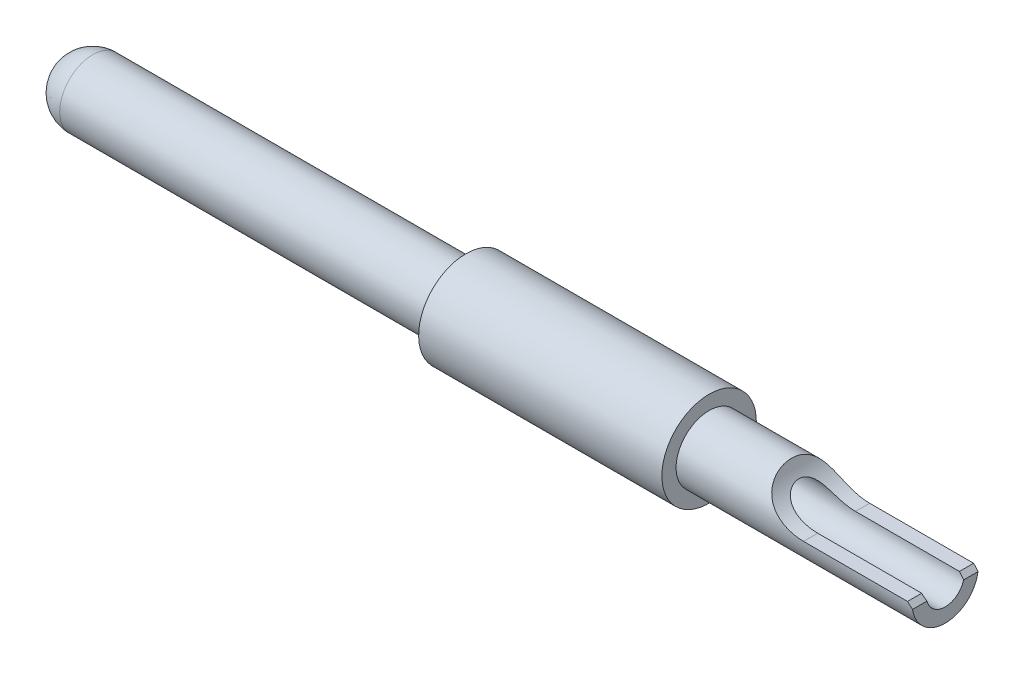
ISO-10303-21;
HEADER;
FILE_DESCRIPTION(('STEP AP214'),'2;1');
FILE_NAME('part.step','',(''),(''),'','','');
FILE_SCHEMA(('AUTOMOTIVE_DESIGN { 1 0 10303 214 1 1 1 1 }'));
ENDSEC;
DATA;
#1=APPLICATION_CONTEXT('core data for automotive mechanical design processes');
#2=APPLICATION_PROTOCOL_DEFINITION('international standard','automotive_design',2000,#1);
#3=PRODUCT_CONTEXT('',#1,'mechanical');
#4=PRODUCT('Part','Part','',(#3));
#5=PRODUCT_RELATED_PRODUCT_CATEGORY('part','',(#4));
#6=PRODUCT_DEFINITION_FORMATION('','',#4);
#7=PRODUCT_DEFINITION_CONTEXT('part definition',#1,'design');
#8=PRODUCT_DEFINITION('design','',#6,#7);
#9=PRODUCT_DEFINITION_SHAPE('','',#8);
#10=(LENGTH_UNIT() NAMED_UNIT(*) SI_UNIT(.MILLI.,.METRE.));
#11=(NAMED_UNIT(*) PLANE_ANGLE_UNIT() SI_UNIT($,.RADIAN.));
#12=(NAMED_UNIT(*) SI_UNIT($,.STERADIAN.) SOLID_ANGLE_UNIT());
#13=UNCERTAINTY_MEASURE_WITH_UNIT(LENGTH_MEASURE(1.E-05),#10,'distance_accuracy_value','');
#14=(GEOMETRIC_REPRESENTATION_CONTEXT(3) GLOBAL_UNCERTAINTY_ASSIGNED_CONTEXT((#13)) GLOBAL_UNIT_ASSIGNED_CONTEXT((#10,
#11,#12)) REPRESENTATION_CONTEXT('',''));
#15=CARTESIAN_POINT('',(0.,0.,0.));
#16=DIRECTION('',(0.,0.,1.));
#17=DIRECTION('',(1.,0.,0.));
#18=AXIS2_PLACEMENT_3D('',#15,#16,#17);
#19=CARTESIAN_POINT('',(9.74999999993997,0.,0.));
#20=DIRECTION('',(1.,0.,0.));
#21=DIRECTION('',(0.,0.,-1.));
#22=AXIS2_PLACEMENT_3D('',#19,#20,#21);
#23=CONICAL_SURFACE('',#22,0.399999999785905,1.04719755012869);
#24=CARTESIAN_POINT('',(9.75,0.,0.));
#25=DIRECTION('',(1.,0.,0.));
#26=DIRECTION('',(0.,0.,-1.));
#27=AXIS2_PLACEMENT_3D('',#24,#25,#26);
#28=CIRCLE('',#27,0.4);
#29=CARTESIAN_POINT('',(9.75000000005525,0.399999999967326,0.));
#30=VERTEX_POINT('',#29);
#31=EDGE_CURVE('E79',#30,#30,#28,.T.);
#32=ORIENTED_EDGE('',*,*,#31,.T.);
#33=DIRECTION('',(-0.499999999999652,-0.86602540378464,0.));
#34=VECTOR('',#33,1.);
#35=CARTESIAN_POINT('',(288107.303385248,499000.,0.));
#36=LINE('',#35,#34);
#37=CARTESIAN_POINT('',(9.51905989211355,-5.11590769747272E-10,0.));
#38=VERTEX_POINT('',#37);
#39=EDGE_CURVE('E81',#38,#30,#36,.F.);
#40=ORIENTED_EDGE('',*,*,#39,.F.);
#41=ORIENTED_EDGE('',*,*,#39,.T.);
#42=EDGE_LOOP('',(#32,#40,#41));
#43=FACE_BOUND('',#42,.T.);
#44=ADVANCED_FACE('F17',(#43),#23,.F.);
#45=CARTESIAN_POINT('',(9.75,0.,0.));
#46=DIRECTION('',(1.,0.,0.));
#47=DIRECTION('',(0.,0.,-1.));
#48=AXIS2_PLACEMENT_3D('',#45,#46,#47);
#49=CYLINDRICAL_SURFACE('',#48,0.4);
#50=CARTESIAN_POINT('',(13.75,0.,0.));
#51=DIRECTION('',(1.,0.,0.));
#52=DIRECTION('',(0.,0.,-1.));
#53=AXIS2_PLACEMENT_3D('',#50,#51,#52);
#54=CIRCLE('',#53,0.4);
#55=CARTESIAN_POINT('',(13.75,-0.0999999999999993,-0.387298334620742));
#56=VERTEX_POINT('',#55);
#57=CARTESIAN_POINT('',(13.75,-0.0999999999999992,0.387298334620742));
#58=VERTEX_POINT('',#57);
#59=EDGE_CURVE('E122',#56,#58,#54,.F.);
#60=ORIENTED_EDGE('',*,*,#59,.F.);
#61=CARTESIAN_POINT('',(13.65,0.,0.));
#62=DIRECTION('',(0.707106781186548,0.707106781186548,0.));
#63=DIRECTION('',(0.707106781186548,-0.707106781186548,0.));
#64=AXIS2_PLACEMENT_3D('',#61,#62,#63);
#65=ELLIPSE('',#64,0.565685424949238,0.4);
#66=CARTESIAN_POINT('',(13.65,0.,-0.4));
#67=VERTEX_POINT('',#66);
#68=EDGE_CURVE('E118',#67,#56,#65,.F.);
#69=ORIENTED_EDGE('',*,*,#68,.F.);
#70=DIRECTION('',(1.,0.,0.));
#71=VECTOR('',#70,1.);
#72=CARTESIAN_POINT('',(11.45,0.,-0.400000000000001));
#73=LINE('',#72,#71);
#74=CARTESIAN_POINT('',(11.45,0.,-0.400000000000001));
#75=VERTEX_POINT('',#74);
#76=EDGE_CURVE('E179',#67,#75,#73,.F.);
#77=ORIENTED_EDGE('',*,*,#76,.T.);
#78=CARTESIAN_POINT('',(11.45,0.,-0.4));
#79=CARTESIAN_POINT('',(11.4220448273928,-2.80562355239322E-06,-0.399978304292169));
#80=CARTESIAN_POINT('',(11.3940904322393,0.00117216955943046,-0.399999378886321));
#81=CARTESIAN_POINT('',(11.3383616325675,0.00585826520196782,-0.399969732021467));
#82=CARTESIAN_POINT('',(11.3105873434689,0.00937075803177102,-0.399918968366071));
#83=CARTESIAN_POINT('',(11.2552149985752,0.0187489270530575,-0.399586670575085));
#84=CARTESIAN_POINT('',(11.2276200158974,0.0246327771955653,-0.399303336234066));
#85=CARTESIAN_POINT('',(11.1730496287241,0.0387027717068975,-0.39818560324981));
#86=CARTESIAN_POINT('',(11.1460739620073,0.0468879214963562,-0.397351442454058));
#87=CARTESIAN_POINT('',(11.0808448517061,0.0697308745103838,-0.394115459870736));
#88=CARTESIAN_POINT('',(11.0430435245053,0.0856392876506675,-0.391173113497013));
#89=CARTESIAN_POINT('',(10.9701525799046,0.121714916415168,-0.381487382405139));
#90=CARTESIAN_POINT('',(10.9350524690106,0.141864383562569,-0.37475964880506));
#91=CARTESIAN_POINT('',(10.8793481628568,0.178364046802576,-0.358393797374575));
#92=CARTESIAN_POINT('',(10.857709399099,0.193855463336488,-0.350384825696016));
#93=CARTESIAN_POINT('',(10.8167282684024,0.225639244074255,-0.330808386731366));
#94=CARTESIAN_POINT('',(10.7973830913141,0.241930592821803,-0.319245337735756));
#95=CARTESIAN_POINT('',(10.7652119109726,0.271001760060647,-0.29469172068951));
#96=CARTESIAN_POINT('',(10.7518571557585,0.283829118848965,-0.282455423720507));
#97=CARTESIAN_POINT('',(10.7273343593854,0.308583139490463,-0.255176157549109));
#98=CARTESIAN_POINT('',(10.716165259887,0.320510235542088,-0.240134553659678));
#99=CARTESIAN_POINT('',(10.6962107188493,0.342711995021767,-0.207231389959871));
#100=CARTESIAN_POINT('',(10.6874445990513,0.352973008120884,-0.189348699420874));
#101=CARTESIAN_POINT('',(10.672605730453,0.370878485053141,-0.151296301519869));
#102=CARTESIAN_POINT('',(10.6665309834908,0.378524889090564,-0.131128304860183));
#103=CARTESIAN_POINT('',(10.6579067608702,0.389564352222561,-0.0925934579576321));
#104=CARTESIAN_POINT('',(10.6549486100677,0.393442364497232,-0.0744551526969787));
#105=CARTESIAN_POINT('',(10.6509917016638,0.39867781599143,-0.0375522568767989));
#106=CARTESIAN_POINT('',(10.6499992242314,0.400027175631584,-0.0187858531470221));
#107=CARTESIAN_POINT('',(10.65,0.4,0.));
#108=B_SPLINE_CURVE_WITH_KNOTS('',3,(#78,#79,#80,#81,#82,#83,#84,#85,#86,#87,#88,#89,#90,#91,
#92,#93,#94,#95,#96,#97,#98,#99,#100,#101,#102,#103,#104,#105,#106,#107),.UNSPECIFIED.,.F.,.F.,
(4,2,2,2,2,2,2,2,2,2,2,2,2,2,4),(0.,0.0838394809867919,0.167728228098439,0.252272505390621,
0.336780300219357,0.459731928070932,0.582178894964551,0.665291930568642,0.74830205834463,
0.81462467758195,0.880915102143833,0.947723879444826,1.01448297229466,1.07055447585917,
1.12680483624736),.UNSPECIFIED.);
#109=CARTESIAN_POINT('',(10.65,0.4,0.));
#110=VERTEX_POINT('',#109);
#111=EDGE_CURVE('E71',#75,#110,#108,.T.);
#112=ORIENTED_EDGE('',*,*,#111,.T.);
#113=DIRECTION('',(1.,0.,0.));
#114=VECTOR('',#113,1.);
#115=CARTESIAN_POINT('',(9.75,0.4,0.));
#116=LINE('',#115,#114);
#117=EDGE_CURVE('E20',#110,#30,#116,.F.);
#118=ORIENTED_EDGE('',*,*,#117,.T.);
#119=ORIENTED_EDGE('',*,*,#31,.F.);
#120=ORIENTED_EDGE('',*,*,#117,.F.);
#121=CARTESIAN_POINT('',(10.65,0.4,0.));
#122=CARTESIAN_POINT('',(10.6499978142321,0.400028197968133,0.0185897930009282));
#123=CARTESIAN_POINT('',(10.6509707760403,0.398705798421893,0.0371661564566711));
#124=CARTESIAN_POINT('',(10.6548484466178,0.393574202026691,0.0737051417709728));
#125=CARTESIAN_POINT('',(10.6577468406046,0.389773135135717,0.0916695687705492));
#126=CARTESIAN_POINT('',(10.6654565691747,0.379896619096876,0.126524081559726));
#127=CARTESIAN_POINT('',(10.6702676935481,0.373821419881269,0.143414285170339));
#128=CARTESIAN_POINT('',(10.6817580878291,0.359775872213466,0.17570170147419));
#129=CARTESIAN_POINT('',(10.6884378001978,0.351805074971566,0.191098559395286));
#130=CARTESIAN_POINT('',(10.703774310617,0.33420263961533,0.220476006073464));
#131=CARTESIAN_POINT('',(10.7124783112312,0.32453296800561,0.234408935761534));
#132=CARTESIAN_POINT('',(10.731606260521,0.304222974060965,0.260228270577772));
#133=CARTESIAN_POINT('',(10.7420311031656,0.293582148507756,0.272113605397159));
#134=CARTESIAN_POINT('',(10.7688722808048,0.267513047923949,0.298157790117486));
#135=CARTESIAN_POINT('',(10.7860225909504,0.251863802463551,0.311340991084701));
#136=CARTESIAN_POINT('',(10.8227527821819,0.220805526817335,0.334091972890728));
#137=CARTESIAN_POINT('',(10.8423369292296,0.205396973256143,0.343653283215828));
#138=CARTESIAN_POINT('',(10.892253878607,0.169199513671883,0.363263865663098));
#139=CARTESIAN_POINT('',(10.923584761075,0.14894962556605,0.371751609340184));
#140=CARTESIAN_POINT('',(10.9889801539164,0.111805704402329,0.384559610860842));
#141=CARTESIAN_POINT('',(11.023052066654,0.0949212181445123,0.38886814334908));
#142=CARTESIAN_POINT('',(11.1072621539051,0.0590510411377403,0.396200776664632));
#143=CARTESIAN_POINT('',(11.1583212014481,0.0419811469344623,0.397999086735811));
#144=CARTESIAN_POINT('',(11.2624631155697,0.0162793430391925,0.399876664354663));
#145=CARTESIAN_POINT('',(11.3155433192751,0.00763670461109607,0.399958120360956));
#146=CARTESIAN_POINT('',(11.3824070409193,0.00219469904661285,0.399993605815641));
#147=CARTESIAN_POINT('',(11.395925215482,0.00137109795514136,0.399997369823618));
#148=CARTESIAN_POINT('',(11.4229608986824,0.000274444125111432,0.400000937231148));
#149=CARTESIAN_POINT('',(11.4364783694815,4.59003678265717E-07,0.400000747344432));
#150=CARTESIAN_POINT('',(11.45,0.,0.4));
#151=B_SPLINE_CURVE_WITH_KNOTS('',3,(#121,#122,#123,#124,#125,#126,#127,#128,#129,#130,#131,
#132,#133,#134,#135,#136,#137,#138,#139,#140,#141,#142,#143,#144,#145,#146,#147,#148,#149,#150),
.UNSPECIFIED.,.F.,.F.,(4,2,2,2,2,2,2,2,2,2,2,2,2,2,4),(0.,0.0556761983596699,0.111170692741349,
0.166659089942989,0.222160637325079,0.279115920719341,0.336100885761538,0.415748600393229,
0.495537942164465,0.609672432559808,0.724126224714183,0.884907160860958,1.04548313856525,
1.08610590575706,1.12665970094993),.UNSPECIFIED.);
#152=CARTESIAN_POINT('',(11.45,0.,0.400000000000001));
#153=VERTEX_POINT('',#152);
#154=EDGE_CURVE('E175',#110,#153,#151,.T.);
#155=ORIENTED_EDGE('',*,*,#154,.T.);
#156=DIRECTION('',(1.,0.,0.));
#157=VECTOR('',#156,1.);
#158=CARTESIAN_POINT('',(11.45,0.,0.400000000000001));
#159=LINE('',#158,#157);
#160=CARTESIAN_POINT('',(13.65,0.,0.400000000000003));
#161=VERTEX_POINT('',#160);
#162=EDGE_CURVE('E221',#153,#161,#159,.T.);
#163=ORIENTED_EDGE('',*,*,#162,.T.);
#164=CARTESIAN_POINT('',(13.65,0.,0.));
#165=DIRECTION('',(0.707106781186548,0.707106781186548,0.));
#166=DIRECTION('',(0.707106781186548,-0.707106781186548,0.));
#167=AXIS2_PLACEMENT_3D('',#164,#165,#166);
#168=ELLIPSE('',#167,0.565685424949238,0.4);
#169=EDGE_CURVE('E169',#58,#161,#168,.F.);
#170=ORIENTED_EDGE('',*,*,#169,.F.);
#171=EDGE_LOOP('',(#60,#69,#77,#112,#118,#119,#120,#155,#163,#170));
#172=FACE_BOUND('',#171,.T.);
#173=ADVANCED_FACE('F183',(#172),#49,.F.);
#174=CARTESIAN_POINT('',(11.45,1.,20.973070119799));
#175=DIRECTION('',(0.,0.,1.));
#176=DIRECTION('',(1.,0.,0.));
#177=AXIS2_PLACEMENT_3D('',#174,#175,#176);
#178=CYLINDRICAL_SURFACE('',#177,1.);
#179=ORIENTED_EDGE('',*,*,#111,.F.);
#180=DIRECTION('',(0.,0.,-1.));
#181=VECTOR('',#180,1.);
#182=CARTESIAN_POINT('',(11.45,0.,20.973070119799));
#183=LINE('',#182,#181);
#184=CARTESIAN_POINT('',(11.45,0.,-0.7));
#185=VERTEX_POINT('',#184);
#186=EDGE_CURVE('E225',#75,#185,#183,.T.);
#187=ORIENTED_EDGE('',*,*,#186,.T.);
#188=CARTESIAN_POINT('',(10.4960607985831,0.7,0.));
#189=CARTESIAN_POINT('',(10.4960637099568,0.700000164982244,-0.018467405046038));
#190=CARTESIAN_POINT('',(10.496290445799,0.699268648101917,-0.036926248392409));
#191=CARTESIAN_POINT('',(10.4972138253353,0.696352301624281,-0.0737180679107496));
#192=CARTESIAN_POINT('',(10.4979104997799,0.694167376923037,-0.0920510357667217));
#193=CARTESIAN_POINT('',(10.5007390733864,0.685446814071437,-0.146699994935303));
#194=CARTESIAN_POINT('',(10.5036095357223,0.67674539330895,-0.182660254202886));
#195=CARTESIAN_POINT('',(10.5117291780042,0.653887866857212,-0.252558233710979));
#196=CARTESIAN_POINT('',(10.5169813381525,0.639724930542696,-0.286493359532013));
#197=CARTESIAN_POINT('',(10.5304671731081,0.606582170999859,-0.351251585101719));
#198=CARTESIAN_POINT('',(10.5386976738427,0.587607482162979,-0.382077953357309));
#199=CARTESIAN_POINT('',(10.5585205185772,0.546379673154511,-0.438942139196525));
#200=CARTESIAN_POINT('',(10.570019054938,0.524225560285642,-0.465084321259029));
#201=CARTESIAN_POINT('',(10.5968988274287,0.477562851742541,-0.512882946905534));
#202=CARTESIAN_POINT('',(10.6122794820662,0.453054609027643,-0.534540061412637));
#203=CARTESIAN_POINT('',(10.6464299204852,0.404069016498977,-0.572410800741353));
#204=CARTESIAN_POINT('',(10.6650594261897,0.379621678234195,-0.588790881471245));
#205=CARTESIAN_POINT('',(10.7058575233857,0.331229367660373,-0.617314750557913));
#206=CARTESIAN_POINT('',(10.7280270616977,0.30728453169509,-0.62945740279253));
#207=CARTESIAN_POINT('',(10.7770175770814,0.259500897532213,-0.650682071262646));
#208=CARTESIAN_POINT('',(10.8040453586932,0.235766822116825,-0.659518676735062));
#209=CARTESIAN_POINT('',(10.8610569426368,0.191011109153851,-0.673845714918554));
#210=CARTESIAN_POINT('',(10.891042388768,0.169990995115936,-0.679334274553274));
#211=CARTESIAN_POINT('',(10.9592876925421,0.127587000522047,-0.688679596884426));
#212=CARTESIAN_POINT('',(10.9980401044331,0.106885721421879,-0.692031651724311));
#213=CARTESIAN_POINT('',(11.0780420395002,0.0707094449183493,-0.69665836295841));
#214=CARTESIAN_POINT('',(11.1192941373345,0.0552399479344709,-0.697930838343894));
#215=CARTESIAN_POINT('',(11.2081464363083,0.0284619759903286,-0.699565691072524));
#216=CARTESIAN_POINT('',(11.2559459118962,0.0177980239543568,-0.699812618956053));
#217=CARTESIAN_POINT('',(11.3283573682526,0.00712539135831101,-0.699971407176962));
#218=CARTESIAN_POINT('',(11.3526070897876,0.00445506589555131,-0.699989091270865));
#219=CARTESIAN_POINT('',(11.4012346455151,0.000892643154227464,-0.700000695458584));
#220=CARTESIAN_POINT('',(11.4256124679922,3.86007388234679E-07,-0.699994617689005));
#221=CARTESIAN_POINT('',(11.45,0.,-0.7));
#222=B_SPLINE_CURVE_WITH_KNOTS('',3,(#188,#189,#190,#191,#192,#193,#194,#195,#196,#197,#198,
#199,#200,#201,#202,#203,#204,#205,#206,#207,#208,#209,#210,#211,#212,#213,#214,#215,#216,#217,
#218,#219,#220,#221),.UNSPECIFIED.,.F.,.F.,(4,2,2,2,2,2,2,2,2,2,2,2,2,2,2,2,4),(0.,
0.0553691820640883,0.110741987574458,0.221504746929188,0.332406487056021,0.443190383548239,
0.55106947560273,0.658932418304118,0.762952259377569,0.866999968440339,0.977702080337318,
1.08846606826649,1.22017166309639,1.35201529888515,1.49835527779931,1.57148879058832,
1.64461572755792),.UNSPECIFIED.);
#223=CARTESIAN_POINT('',(10.4960607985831,0.7,0.));
#224=VERTEX_POINT('',#223);
#225=EDGE_CURVE('E138',#224,#185,#222,.T.);
#226=ORIENTED_EDGE('',*,*,#225,.F.);
#227=CARTESIAN_POINT('',(11.45,0.,0.7));
#228=CARTESIAN_POINT('',(11.4202965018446,-3.36969864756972E-06,0.699984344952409));
#229=CARTESIAN_POINT('',(11.3905945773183,0.00132342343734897,0.699999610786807));
#230=CARTESIAN_POINT('',(11.331421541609,0.00661188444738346,0.699977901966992));
#231=CARTESIAN_POINT('',(11.3019504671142,0.0105739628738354,0.69994091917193));
#232=CARTESIAN_POINT('',(11.2432901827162,0.021141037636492,0.699699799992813));
#233=CARTESIAN_POINT('',(11.214103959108,0.0277626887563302,0.699494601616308));
#234=CARTESIAN_POINT('',(11.1564575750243,0.0435862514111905,0.698686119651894));
#235=CARTESIAN_POINT('',(11.1279973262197,0.0527878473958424,0.698082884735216));
#236=CARTESIAN_POINT('',(11.047310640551,0.0829400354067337,0.695355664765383));
#237=CARTESIAN_POINT('',(10.9962608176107,0.107095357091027,0.692359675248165));
#238=CARTESIAN_POINT('',(10.8995171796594,0.163298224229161,0.681280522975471));
#239=CARTESIAN_POINT('',(10.8537999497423,0.19530919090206,0.673220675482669));
#240=CARTESIAN_POINT('',(10.7828657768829,0.25411740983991,0.652733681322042));
#241=CARTESIAN_POINT('',(10.7557345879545,0.279368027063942,0.642489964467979));
#242=CARTESIAN_POINT('',(10.7054662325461,0.331439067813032,0.617238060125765));
#243=CARTESIAN_POINT('',(10.6823263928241,0.358258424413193,0.602233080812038));
#244=CARTESIAN_POINT('',(10.6403830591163,0.4120446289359,0.566797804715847));
#245=CARTESIAN_POINT('',(10.6216045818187,0.439011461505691,0.546337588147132));
#246=CARTESIAN_POINT('',(10.5886299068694,0.491085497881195,0.500046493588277));
#247=CARTESIAN_POINT('',(10.5744333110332,0.516192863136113,0.474216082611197));
#248=CARTESIAN_POINT('',(10.5513565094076,0.560669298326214,0.420422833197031));
#249=CARTESIAN_POINT('',(10.5421066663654,0.580354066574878,0.392876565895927));
#250=CARTESIAN_POINT('',(10.5265474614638,0.615797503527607,0.334599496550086));
#251=CARTESIAN_POINT('',(10.5202393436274,0.631554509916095,0.303867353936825));
#252=CARTESIAN_POINT('',(10.5099535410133,0.658641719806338,0.239634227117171));
#253=CARTESIAN_POINT('',(10.5060097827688,0.669906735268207,0.20610045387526));
#254=CARTESIAN_POINT('',(10.5001177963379,0.68725016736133,0.137592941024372));
#255=CARTESIAN_POINT('',(10.4981670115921,0.693335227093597,0.102621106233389));
#256=CARTESIAN_POINT('',(10.4964042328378,0.698918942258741,0.0449885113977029));
#257=CARTESIAN_POINT('',(10.4960717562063,0.700010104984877,0.022488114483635));
#258=CARTESIAN_POINT('',(10.4960607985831,0.7,0.));
#259=B_SPLINE_CURVE_WITH_KNOTS('',3,(#227,#228,#229,#230,#231,#232,#233,#234,#235,#236,#237,
#238,#239,#240,#241,#242,#243,#244,#245,#246,#247,#248,#249,#250,#251,#252,#253,#254,#255,#256,
#257,#258),.UNSPECIFIED.,.F.,.F.,(4,2,2,2,2,2,2,2,2,2,2,2,2,2,2,4),(0.,0.0890780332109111,
0.178169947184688,0.267828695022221,0.357476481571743,0.526188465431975,0.69412929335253,
0.809026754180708,0.923846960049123,1.03931034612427,1.15476369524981,1.2595658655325,
1.36441231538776,1.47072929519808,1.57690972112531,1.64437624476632),.UNSPECIFIED.);
#260=CARTESIAN_POINT('',(11.45,0.,0.7));
#261=VERTEX_POINT('',#260);
#262=EDGE_CURVE('E162',#261,#224,#259,.T.);
#263=ORIENTED_EDGE('',*,*,#262,.F.);
#264=DIRECTION('',(0.,0.,-1.));
#265=VECTOR('',#264,1.);
#266=CARTESIAN_POINT('',(11.45,0.,20.973070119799));
#267=LINE('',#266,#265);
#268=EDGE_CURVE('E218',#261,#153,#267,.T.);
#269=ORIENTED_EDGE('',*,*,#268,.T.);
#270=ORIENTED_EDGE('',*,*,#154,.F.);
#271=EDGE_LOOP('',(#179,#187,#226,#263,#269,#270));
#272=FACE_BOUND('',#271,.T.);
#273=ADVANCED_FACE('F150',(#272),#178,.F.);
#274=CARTESIAN_POINT('',(11.45,0.,20.973070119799));
#275=DIRECTION('',(0.,-1.,0.));
#276=DIRECTION('',(0.,0.,-1.));
#277=AXIS2_PLACEMENT_3D('',#274,#275,#276);
#278=PLANE('',#277);
#279=DIRECTION('',(-1.,0.,0.));
#280=VECTOR('',#279,1.);
#281=CARTESIAN_POINT('',(13.75,0.,-0.7));
#282=LINE('',#281,#280);
#283=CARTESIAN_POINT('',(13.65,0.,-0.7));
#284=VERTEX_POINT('',#283);
#285=EDGE_CURVE('E136',#185,#284,#282,.F.);
#286=ORIENTED_EDGE('',*,*,#285,.F.);
#287=ORIENTED_EDGE('',*,*,#186,.F.);
#288=ORIENTED_EDGE('',*,*,#76,.F.);
#289=DIRECTION('',(0.,0.,1.));
#290=VECTOR('',#289,1.);
#291=CARTESIAN_POINT('',(13.65,0.,-0.7));
#292=LINE('',#291,#290);
#293=EDGE_CURVE('E174',#284,#67,#292,.T.);
#294=ORIENTED_EDGE('',*,*,#293,.F.);
#295=EDGE_LOOP('',(#286,#287,#288,#294));
#296=FACE_BOUND('',#295,.T.);
#297=ADVANCED_FACE('F192',(#296),#278,.F.);
#298=CARTESIAN_POINT('',(13.7,-0.05,-0.7));
#299=DIRECTION('',(0.707106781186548,0.707106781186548,0.));
#300=DIRECTION('',(-0.707106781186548,0.707106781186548,0.));
#301=AXIS2_PLACEMENT_3D('',#298,#299,#300);
#302=PLANE('',#301);
#303=DIRECTION('',(0.,0.,-1.));
#304=VECTOR('',#303,1.);
#305=CARTESIAN_POINT('',(13.75,-0.1,0.));
#306=LINE('',#305,#304);
#307=CARTESIAN_POINT('',(13.75,-0.0999999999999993,-0.692820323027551));
#308=VERTEX_POINT('',#307);
#309=EDGE_CURVE('E110',#308,#56,#306,.F.);
#310=ORIENTED_EDGE('',*,*,#309,.F.);
#311=CARTESIAN_POINT('',(13.65,0.,0.));
#312=DIRECTION('',(0.707106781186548,0.707106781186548,0.));
#313=DIRECTION('',(-0.707106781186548,0.707106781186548,0.));
#314=AXIS2_PLACEMENT_3D('',#311,#312,#313);
#315=ELLIPSE('',#314,0.989949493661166,0.7);
#316=EDGE_CURVE('E115',#284,#308,#315,.F.);
#317=ORIENTED_EDGE('',*,*,#316,.F.);
#318=ORIENTED_EDGE('',*,*,#293,.T.);
#319=ORIENTED_EDGE('',*,*,#68,.T.);
#320=EDGE_LOOP('',(#310,#317,#318,#319));
#321=FACE_BOUND('',#320,.T.);
#322=ADVANCED_FACE('F112',(#321),#302,.T.);
#323=CARTESIAN_POINT('',(13.75,0.,0.));
#324=DIRECTION('',(1.,0.,0.));
#325=DIRECTION('',(0.,0.,-1.));
#326=AXIS2_PLACEMENT_3D('',#323,#324,#325);
#327=PLANE('',#326);
#328=DIRECTION('',(0.,0.,1.));
#329=VECTOR('',#328,1.);
#330=CARTESIAN_POINT('',(13.75,-0.0999999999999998,0.4));
#331=LINE('',#330,#329);
#332=CARTESIAN_POINT('',(13.75,-0.0999999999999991,0.692820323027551));
#333=VERTEX_POINT('',#332);
#334=EDGE_CURVE('E128',#333,#58,#331,.F.);
#335=ORIENTED_EDGE('',*,*,#334,.F.);
#336=CARTESIAN_POINT('',(13.75,0.,0.));
#337=DIRECTION('',(-1.,0.,0.));
#338=DIRECTION('',(0.,0.,1.));
#339=AXIS2_PLACEMENT_3D('',#336,#337,#338);
#340=CIRCLE('',#339,0.7);
#341=EDGE_CURVE('E125',#308,#333,#340,.T.);
#342=ORIENTED_EDGE('',*,*,#341,.F.);
#343=ORIENTED_EDGE('',*,*,#309,.T.);
#344=ORIENTED_EDGE('',*,*,#59,.T.);
#345=EDGE_LOOP('',(#335,#342,#343,#344));
#346=FACE_BOUND('',#345,.T.);
#347=ADVANCED_FACE('F126',(#346),#327,.T.);
#348=CARTESIAN_POINT('',(13.7,-0.05,0.4));
#349=DIRECTION('',(0.707106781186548,0.707106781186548,0.));
#350=DIRECTION('',(-0.707106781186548,0.707106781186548,0.));
#351=AXIS2_PLACEMENT_3D('',#348,#349,#350);
#352=PLANE('',#351);
#353=CARTESIAN_POINT('',(13.65,0.,0.));
#354=DIRECTION('',(0.707106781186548,0.707106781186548,0.));
#355=DIRECTION('',(-0.707106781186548,0.707106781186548,0.));
#356=AXIS2_PLACEMENT_3D('',#353,#354,#355);
#357=ELLIPSE('',#356,0.989949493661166,0.7);
#358=CARTESIAN_POINT('',(13.65,0.,0.700000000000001));
#359=VERTEX_POINT('',#358);
#360=EDGE_CURVE('E131',#333,#359,#357,.F.);
#361=ORIENTED_EDGE('',*,*,#360,.F.);
#362=ORIENTED_EDGE('',*,*,#334,.T.);
#363=ORIENTED_EDGE('',*,*,#169,.T.);
#364=DIRECTION('',(0.,0.,-1.));
#365=VECTOR('',#364,1.);
#366=CARTESIAN_POINT('',(13.65,0.,20.973070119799));
#367=LINE('',#366,#365);
#368=EDGE_CURVE('E168',#161,#359,#367,.F.);
#369=ORIENTED_EDGE('',*,*,#368,.T.);
#370=EDGE_LOOP('',(#361,#362,#363,#369));
#371=FACE_BOUND('',#370,.T.);
#372=ADVANCED_FACE('F250',(#371),#352,.T.);
#373=CARTESIAN_POINT('',(11.45,0.,20.973070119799));
#374=DIRECTION('',(0.,-1.,0.));
#375=DIRECTION('',(0.,0.,-1.));
#376=AXIS2_PLACEMENT_3D('',#373,#374,#375);
#377=PLANE('',#376);
#378=ORIENTED_EDGE('',*,*,#162,.F.);
#379=ORIENTED_EDGE('',*,*,#268,.F.);
#380=DIRECTION('',(-1.,0.,0.));
#381=VECTOR('',#380,1.);
#382=CARTESIAN_POINT('',(13.75,0.,0.7));
#383=LINE('',#382,#381);
#384=EDGE_CURVE('E215',#359,#261,#383,.T.);
#385=ORIENTED_EDGE('',*,*,#384,.F.);
#386=ORIENTED_EDGE('',*,*,#368,.F.);
#387=EDGE_LOOP('',(#378,#379,#385,#386));
#388=FACE_BOUND('',#387,.T.);
#389=ADVANCED_FACE('F158',(#388),#377,.F.);
#390=CARTESIAN_POINT('',(13.75,0.,0.));
#391=DIRECTION('',(-1.,0.,0.));
#392=DIRECTION('',(0.,0.,1.));
#393=AXIS2_PLACEMENT_3D('',#390,#391,#392);
#394=CYLINDRICAL_SURFACE('',#393,0.7);
#395=ORIENTED_EDGE('',*,*,#360,.T.);
#396=ORIENTED_EDGE('',*,*,#384,.T.);
#397=ORIENTED_EDGE('',*,*,#262,.T.);
#398=DIRECTION('',(-1.,0.,0.));
#399=VECTOR('',#398,1.);
#400=CARTESIAN_POINT('',(13.75,0.7,0.));
#401=LINE('',#400,#399);
#402=CARTESIAN_POINT('',(8.75,0.7,0.));
#403=VERTEX_POINT('',#402);
#404=EDGE_CURVE('E148',#224,#403,#401,.T.);
#405=ORIENTED_EDGE('',*,*,#404,.T.);
#406=CARTESIAN_POINT('',(8.75,0.,0.));
#407=DIRECTION('',(-1.,0.,0.));
#408=DIRECTION('',(0.,0.,1.));
#409=AXIS2_PLACEMENT_3D('',#406,#407,#408);
#410=CIRCLE('',#409,0.7);
#411=EDGE_CURVE('E35',#403,#403,#410,.T.);
#412=ORIENTED_EDGE('',*,*,#411,.F.);
#413=ORIENTED_EDGE('',*,*,#404,.F.);
#414=ORIENTED_EDGE('',*,*,#225,.T.);
#415=ORIENTED_EDGE('',*,*,#285,.T.);
#416=ORIENTED_EDGE('',*,*,#316,.T.);
#417=ORIENTED_EDGE('',*,*,#341,.T.);
#418=EDGE_LOOP('',(#395,#396,#397,#405,#412,#413,#414,#415,#416,#417));
#419=FACE_BOUND('',#418,.T.);
#420=ADVANCED_FACE('F133',(#419),#394,.T.);
#421=CARTESIAN_POINT('',(8.75,0.,0.));
#422=DIRECTION('',(1.,0.,0.));
#423=DIRECTION('',(0.,0.,-1.));
#424=AXIS2_PLACEMENT_3D('',#421,#422,#423);
#425=PLANE('',#424);
#426=CARTESIAN_POINT('',(8.75,0.,0.));
#427=DIRECTION('',(-1.,0.,0.));
#428=DIRECTION('',(0.,0.,1.));
#429=AXIS2_PLACEMENT_3D('',#426,#427,#428);
#430=CIRCLE('',#429,1.);
#431=CARTESIAN_POINT('',(8.75,1.,0.));
#432=VERTEX_POINT('',#431);
#433=EDGE_CURVE('E242',#432,#432,#430,.T.);
#434=ORIENTED_EDGE('',*,*,#433,.F.);
#435=EDGE_LOOP('',(#434));
#436=FACE_BOUND('',#435,.T.);
#437=ORIENTED_EDGE('',*,*,#411,.T.);
#438=EDGE_LOOP('',(#437));
#439=FACE_BOUND('',#438,.T.);
#440=ADVANCED_FACE('F157',(#436,#439),#425,.T.);
#441=CARTESIAN_POINT('',(8.75,0.,0.));
#442=DIRECTION('',(-1.,0.,0.));
#443=DIRECTION('',(0.,0.,1.));
#444=AXIS2_PLACEMENT_3D('',#441,#442,#443);
#445=CYLINDRICAL_SURFACE('',#444,1.);
#446=DIRECTION('',(-1.,0.,0.));
#447=VECTOR('',#446,1.);
#448=CARTESIAN_POINT('',(8.75,1.,0.));
#449=LINE('',#448,#447);
#450=CARTESIAN_POINT('',(3.6,1.,0.));
#451=VERTEX_POINT('',#450);
#452=EDGE_CURVE('E245',#432,#451,#449,.T.);
#453=ORIENTED_EDGE('',*,*,#452,.F.);
#454=ORIENTED_EDGE('',*,*,#433,.T.);
#455=ORIENTED_EDGE('',*,*,#452,.T.);
#456=CARTESIAN_POINT('',(3.6,0.,0.));
#457=DIRECTION('',(-1.,0.,0.));
#458=DIRECTION('',(0.,0.,1.));
#459=AXIS2_PLACEMENT_3D('',#456,#457,#458);
#460=CIRCLE('',#459,1.);
#461=EDGE_CURVE('E237',#451,#451,#460,.F.);
#462=ORIENTED_EDGE('',*,*,#461,.T.);
#463=EDGE_LOOP('',(#453,#454,#455,#462));
#464=FACE_BOUND('',#463,.T.);
#465=ADVANCED_FACE('F209',(#464),#445,.T.);
#466=CARTESIAN_POINT('',(-4.3,0.,0.));
#467=DIRECTION('',(0.,1.,0.));
#468=DIRECTION('',(0.,0.,-1.));
#469=AXIS2_PLACEMENT_3D('',#466,#467,#468);
#470=SPHERICAL_SURFACE('',#469,0.7);
#471=CARTESIAN_POINT('',(-4.3,0.,0.));
#472=DIRECTION('',(-1.,0.,0.));
#473=DIRECTION('',(0.,0.,1.));
#474=AXIS2_PLACEMENT_3D('',#471,#472,#473);
#475=CIRCLE('',#474,0.7);
#476=CARTESIAN_POINT('',(-4.3,-0.7,0.));
#477=VERTEX_POINT('',#476);
#478=CARTESIAN_POINT('',(-4.3,0.7,0.));
#479=VERTEX_POINT('',#478);
#480=EDGE_CURVE('E26',#477,#479,#475,.F.);
#481=ORIENTED_EDGE('',*,*,#480,.F.);
#482=CARTESIAN_POINT('',(-4.3,0.,0.));
#483=DIRECTION('',(-1.,0.,0.));
#484=DIRECTION('',(0.,0.,1.));
#485=AXIS2_PLACEMENT_3D('',#482,#483,#484);
#486=CIRCLE('',#485,0.7);
#487=EDGE_CURVE('E214',#479,#477,#486,.F.);
#488=ORIENTED_EDGE('',*,*,#487,.F.);
#489=CARTESIAN_POINT('',(-4.3,0.,0.));
#490=DIRECTION('',(0.,0.,1.));
#491=DIRECTION('',(0.,1.,0.));
#492=AXIS2_PLACEMENT_3D('',#489,#490,#491);
#493=CIRCLE('',#492,0.7);
#494=CARTESIAN_POINT('',(-5.,0.,0.));
#495=VERTEX_POINT('',#494);
#496=EDGE_CURVE('E239',#495,#479,#493,.F.);
#497=ORIENTED_EDGE('',*,*,#496,.F.);
#498=ORIENTED_EDGE('',*,*,#496,.T.);
#499=EDGE_LOOP('',(#481,#488,#497,#498));
#500=FACE_BOUND('',#499,.T.);
#501=ADVANCED_FACE('F202',(#500),#470,.T.);
#502=CARTESIAN_POINT('',(3.6,0.,0.));
#503=DIRECTION('',(1.,0.,0.));
#504=DIRECTION('',(0.,0.,-1.));
#505=AXIS2_PLACEMENT_3D('',#502,#503,#504);
#506=PLANE('',#505);
#507=CARTESIAN_POINT('',(3.6,0.,0.));
#508=DIRECTION('',(-1.,0.,0.));
#509=DIRECTION('',(0.,0.,1.));
#510=AXIS2_PLACEMENT_3D('',#507,#508,#509);
#511=CIRCLE('',#510,0.7);
#512=CARTESIAN_POINT('',(3.6,0.7,0.));
#513=VERTEX_POINT('',#512);
#514=EDGE_CURVE('E11',#513,#513,#511,.T.);
#515=ORIENTED_EDGE('',*,*,#514,.F.);
#516=EDGE_LOOP('',(#515));
#517=FACE_BOUND('',#516,.T.);
#518=ORIENTED_EDGE('',*,*,#461,.F.);
#519=EDGE_LOOP('',(#518));
#520=FACE_BOUND('',#519,.T.);
#521=ADVANCED_FACE('F196',(#517,#520),#506,.F.);
#522=CARTESIAN_POINT('',(3.6,0.,0.));
#523=DIRECTION('',(-1.,0.,0.));
#524=DIRECTION('',(0.,0.,1.));
#525=AXIS2_PLACEMENT_3D('',#522,#523,#524);
#526=CYLINDRICAL_SURFACE('',#525,0.7);
#527=DIRECTION('',(-1.,0.,0.));
#528=VECTOR('',#527,1.);
#529=CARTESIAN_POINT('',(3.6,0.7,0.));
#530=LINE('',#529,#528);
#531=EDGE_CURVE('E234',#513,#479,#530,.T.);
#532=ORIENTED_EDGE('',*,*,#531,.F.);
#533=ORIENTED_EDGE('',*,*,#514,.T.);
#534=ORIENTED_EDGE('',*,*,#531,.T.);
#535=ORIENTED_EDGE('',*,*,#487,.T.);
#536=ORIENTED_EDGE('',*,*,#480,.T.);
#537=EDGE_LOOP('',(#532,#533,#534,#535,#536));
#538=FACE_BOUND('',#537,.T.);
#539=ADVANCED_FACE('F194',(#538),#526,.T.);
#540=CLOSED_SHELL('',(#44,#173,#273,#297,#322,#347,#372,#389,#420,#440,#465,#501,#521,#539));
#541=MANIFOLD_SOLID_BREP('B1',#540);
#542=ADVANCED_BREP_SHAPE_REPRESENTATION('',(#18,#541),#14);
#543=SHAPE_DEFINITION_REPRESENTATION(#9,#542);
ENDSEC;
END-ISO-10303-21;
